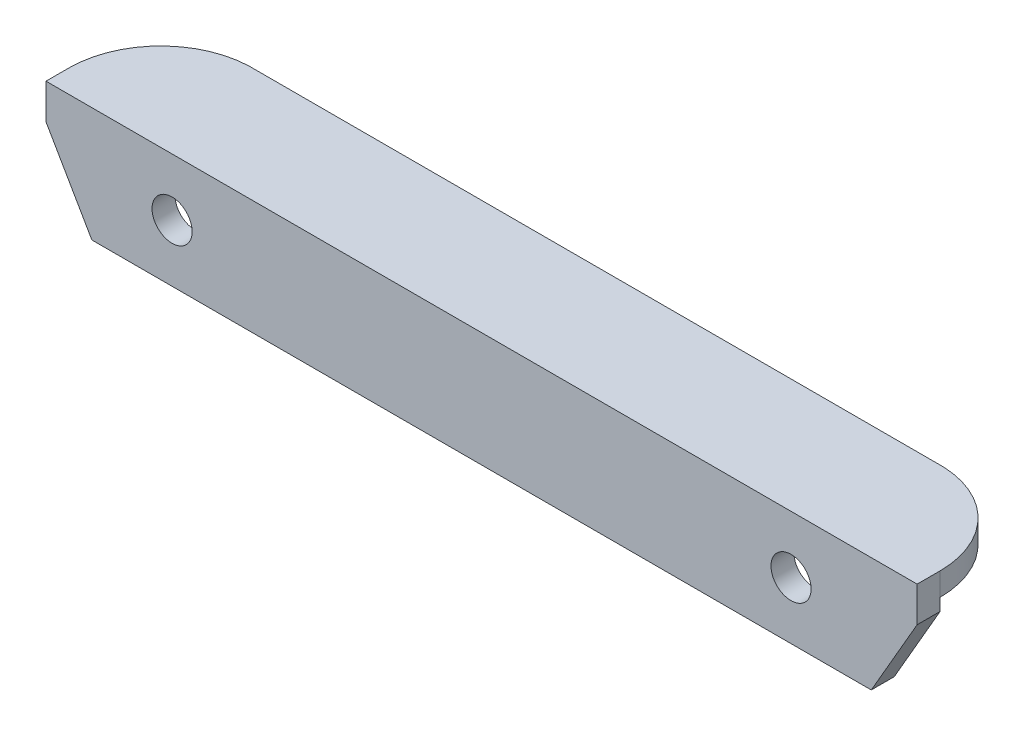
from build123d import *

# Parameters (mm, degrees)
EXTRUDE1_DEPTH = 76
EXTRUDE2_DEPTH = 76
SKETCH4_R      = 1.75
EXTRUDE3_DEPTH = 76


with BuildPart() as part:
    # Sketch2 → Extrude1 (new body)
    with BuildSketch(Plane(origin=(0, 0, 0), x_dir=(0, 0, -1), z_dir=(1, 0, 0))):
        Polygon((0, 0), (0, 10), (10, 10), (10, 8), (2, 8), (2, 0), align=None)
    extrude(amount=EXTRUDE1_DEPTH)

    # Sketch3 → Extrude2 (cut)
    with BuildSketch(Plane(origin=(0, 10, 0), x_dir=(1, 0, 0), z_dir=(0, 1, 0))):
        with BuildLine():
            Line((76, 2.006209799), (76, 10))
            Line((76, 10), (68.315090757, 10))
            ThreePointArc((68.315090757, 10), (73.767180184, 7.550543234), (76, 2.006209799))
        make_face()
        with BuildLine():
            ThreePointArc((0, 2.006209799), (2.232823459, 7.550543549), (7.68491484, 10))
            Line((7.68491484, 10), (0, 10))
            Line((0, 10), (0, 2.006209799))
        make_face()
    extrude(amount=-EXTRUDE2_DEPTH, mode=Mode.SUBTRACT)

    # Sketch4 → Extrude3 (cut)
    with BuildSketch(Plane(origin=(0, 0, -2), x_dir=(-1, 0, 0), z_dir=(0, 0, -1))):
        with Locations((-11, 5)):
            Circle(SKETCH4_R)
        with Locations((-65, 5)):
            Circle(SKETCH4_R)
        Polygon((0, 6.92820323), (-4, 0), (0, 0), align=None)
        Polygon((-76, 6.92820323), (-72, 0), (-76, 0), align=None)
    extrude(amount=-EXTRUDE3_DEPTH, mode=Mode.SUBTRACT)


solid = part.part
